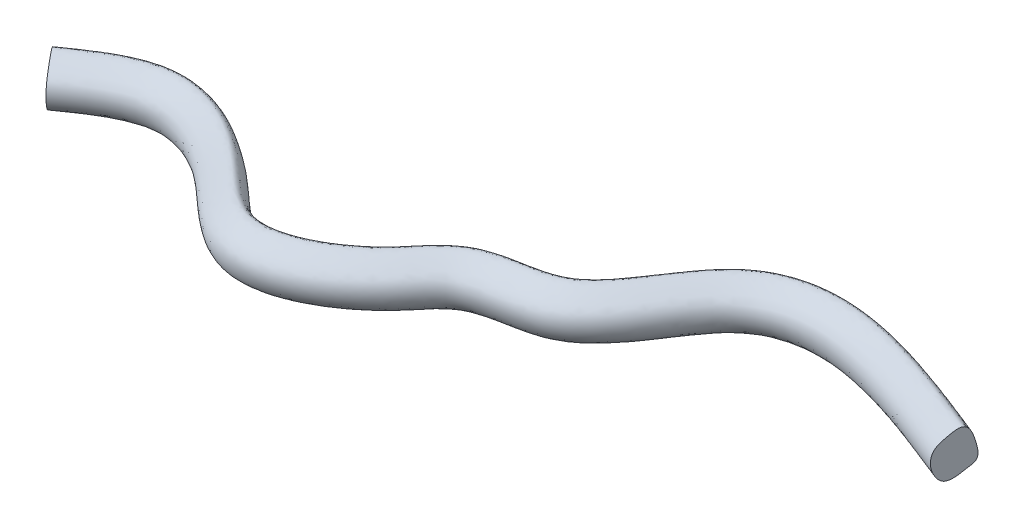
ISO-10303-21;
HEADER;
FILE_DESCRIPTION(('STEP AP214'),'2;1');
FILE_NAME('part.step','',(''),(''),'','','');
FILE_SCHEMA(('AUTOMOTIVE_DESIGN { 1 0 10303 214 1 1 1 1 }'));
ENDSEC;
DATA;
#1=APPLICATION_CONTEXT('core data for automotive mechanical design processes');
#2=APPLICATION_PROTOCOL_DEFINITION('international standard','automotive_design',2000,#1);
#3=PRODUCT_CONTEXT('',#1,'mechanical');
#4=PRODUCT('Part','Part','',(#3));
#5=PRODUCT_RELATED_PRODUCT_CATEGORY('part','',(#4));
#6=PRODUCT_DEFINITION_FORMATION('','',#4);
#7=PRODUCT_DEFINITION_CONTEXT('part definition',#1,'design');
#8=PRODUCT_DEFINITION('design','',#6,#7);
#9=PRODUCT_DEFINITION_SHAPE('','',#8);
#10=(LENGTH_UNIT() NAMED_UNIT(*) SI_UNIT(.MILLI.,.METRE.));
#11=(NAMED_UNIT(*) PLANE_ANGLE_UNIT() SI_UNIT($,.RADIAN.));
#12=(NAMED_UNIT(*) SI_UNIT($,.STERADIAN.) SOLID_ANGLE_UNIT());
#13=UNCERTAINTY_MEASURE_WITH_UNIT(LENGTH_MEASURE(1.E-05),#10,'distance_accuracy_value','');
#14=(GEOMETRIC_REPRESENTATION_CONTEXT(3) GLOBAL_UNCERTAINTY_ASSIGNED_CONTEXT((#13)) GLOBAL_UNIT_ASSIGNED_CONTEXT((#10,
#11,#12)) REPRESENTATION_CONTEXT('',''));
#15=CARTESIAN_POINT('',(0.,0.,0.));
#16=DIRECTION('',(0.,0.,1.));
#17=DIRECTION('',(1.,0.,0.));
#18=AXIS2_PLACEMENT_3D('',#15,#16,#17);
#19=CARTESIAN_POINT('',(489.62322241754,-7.97573868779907,-61.8399710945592));
#20=DIRECTION('',(-0.92851920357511,0.,-0.371284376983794));
#21=DIRECTION('',(-0.371284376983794,0.,0.92851920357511));
#22=AXIS2_PLACEMENT_3D('',#19,#20,#21);
#23=PLANE('',#22);
#24=CARTESIAN_POINT('',(488.404273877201,19.1868210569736,-58.7915877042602));
#25=CARTESIAN_POINT('',(487.05176218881,16.8016183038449,-55.4091855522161));
#26=CARTESIAN_POINT('',(484.873943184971,12.9421402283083,-49.9628298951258));
#27=CARTESIAN_POINT('',(484.06816624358,0.761024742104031,-47.9477185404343));
#28=CARTESIAN_POINT('',(487.092163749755,-13.249863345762,-55.5102229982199));
#29=CARTESIAN_POINT('',(493.313817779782,-1.54614979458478,-71.0695236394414));
#30=CARTESIAN_POINT('',(495.252782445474,-0.278483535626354,-75.918545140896));
#31=CARTESIAN_POINT('',(492.23779678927,25.931165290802,-68.3785777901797));
#32=CARTESIAN_POINT('',(490.142359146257,22.2519966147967,-63.1382439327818));
#33=CARTESIAN_POINT('',(488.404273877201,19.1868210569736,-58.7915877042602));
#34=B_SPLINE_CURVE_WITH_KNOTS('',3,(#24,#25,#26,#27,#28,#29,#30,#31,#32,#33),.UNSPECIFIED.,.T.,
.F.,(4,1,1,1,1,2,4),(0.,0.138177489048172,0.264870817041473,0.420878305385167,0.588308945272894,
0.822430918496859,1.),.UNSPECIFIED.);
#35=CARTESIAN_POINT('',(488.404273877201,19.1868210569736,-58.7915877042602));
#36=VERTEX_POINT('',#35);
#37=EDGE_CURVE('E57',#36,#36,#34,.T.);
#38=ORIENTED_EDGE('',*,*,#37,.T.);
#39=EDGE_LOOP('',(#38));
#40=FACE_BOUND('',#39,.T.);
#41=ADVANCED_FACE('F48',(#40),#23,.F.);
#42=CARTESIAN_POINT('',(-74.1154910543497,-7.97573868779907,29.8287356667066));
#43=DIRECTION('',(-0.817208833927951,0.,0.576341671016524));
#44=DIRECTION('',(0.576341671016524,0.,0.817208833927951));
#45=AXIS2_PLACEMENT_3D('',#42,#43,#44);
#46=PLANE('',#45);
#47=CARTESIAN_POINT('',(-72.2233273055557,19.1868210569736,32.5116805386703));
#48=CARTESIAN_POINT('',(-70.1238345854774,16.8016183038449,35.4886021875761));
#49=CARTESIAN_POINT('',(-66.7432241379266,12.9421402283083,40.2820517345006));
#50=CARTESIAN_POINT('',(-65.4924232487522,0.761024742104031,42.0555926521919));
#51=CARTESIAN_POINT('',(-70.1865495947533,-13.249863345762,35.3996770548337));
#52=CARTESIAN_POINT('',(-79.8443717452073,-1.54614979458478,21.7056167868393));
#53=CARTESIAN_POINT('',(-82.8542105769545,-0.278483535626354,17.4378933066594));
#54=CARTESIAN_POINT('',(-78.1740732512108,25.931165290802,24.0739735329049));
#55=CARTESIAN_POINT('',(-74.9213427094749,22.2519966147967,28.6860990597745));
#56=CARTESIAN_POINT('',(-72.2233273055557,19.1868210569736,32.5116805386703));
#57=B_SPLINE_CURVE_WITH_KNOTS('',3,(#47,#48,#49,#50,#51,#52,#53,#54,#55,#56),.UNSPECIFIED.,.T.,
.F.,(4,1,1,1,1,2,4),(0.,0.138177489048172,0.264870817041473,0.420878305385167,0.588308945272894,
0.822430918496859,1.),.UNSPECIFIED.);
#58=CARTESIAN_POINT('',(-72.2233273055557,19.1868210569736,32.5116805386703));
#59=VERTEX_POINT('',#58);
#60=EDGE_CURVE('E11',#59,#59,#57,.T.);
#61=ORIENTED_EDGE('',*,*,#60,.F.);
#62=EDGE_LOOP('',(#61));
#63=FACE_BOUND('',#62,.T.);
#64=ADVANCED_FACE('F50',(#63),#46,.T.);
#65=CARTESIAN_POINT('',(-72.2233273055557,19.1868210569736,32.5116805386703));
#66=CARTESIAN_POINT('',(-66.4321312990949,19.1868210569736,28.4274170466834));
#67=CARTESIAN_POINT('',(-54.8497392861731,19.1868210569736,20.2588900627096));
#68=CARTESIAN_POINT('',(-37.1470998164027,19.1868210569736,10.231216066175));
#69=CARTESIAN_POINT('',(-24.617602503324,19.1868210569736,6.45367876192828));
#70=CARTESIAN_POINT('',(-12.0781668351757,19.1868210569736,5.14505596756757));
#71=CARTESIAN_POINT('',(7.17624918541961,19.1868210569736,6.6392831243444));
#72=CARTESIAN_POINT('',(27.8970371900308,19.1868210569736,17.0897147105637));
#73=CARTESIAN_POINT('',(51.003205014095,19.1868210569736,34.241826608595));
#74=CARTESIAN_POINT('',(64.6861095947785,19.1868210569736,47.7929007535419));
#75=CARTESIAN_POINT('',(80.4896973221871,19.1868210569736,60.1644329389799));
#76=CARTESIAN_POINT('',(89.7783298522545,19.1868210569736,65.4418913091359));
#77=CARTESIAN_POINT('',(97.3213313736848,19.1868210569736,68.0033436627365));
#78=CARTESIAN_POINT('',(105.191920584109,19.1868210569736,69.4591728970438));
#79=CARTESIAN_POINT('',(115.132071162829,19.1868210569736,69.4418272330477));
#80=CARTESIAN_POINT('',(128.007667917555,19.1868210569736,66.660395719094));
#81=CARTESIAN_POINT('',(143.893664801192,19.1868210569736,60.3505195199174));
#82=CARTESIAN_POINT('',(161.903048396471,19.1868210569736,49.1679760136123));
#83=CARTESIAN_POINT('',(174.10468618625,19.1868210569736,38.0891082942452));
#84=CARTESIAN_POINT('',(183.649802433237,19.1868210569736,27.6605868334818));
#85=CARTESIAN_POINT('',(190.725184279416,19.1868210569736,18.6598702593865));
#86=CARTESIAN_POINT('',(198.935044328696,19.1868210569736,10.9014222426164));
#87=CARTESIAN_POINT('',(211.028158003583,19.1868210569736,3.8214814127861));
#88=CARTESIAN_POINT('',(229.450798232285,19.1868210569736,0.0955129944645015));
#89=CARTESIAN_POINT('',(247.508665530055,19.1868210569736,-3.20418501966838));
#90=CARTESIAN_POINT('',(263.128414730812,19.1868210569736,-10.5229592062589));
#91=CARTESIAN_POINT('',(279.727621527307,19.1868210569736,-24.8918301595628));
#92=CARTESIAN_POINT('',(296.8354193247,19.1868210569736,-53.2556760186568));
#93=CARTESIAN_POINT('',(312.80972250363,19.1868210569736,-74.2353060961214));
#94=CARTESIAN_POINT('',(327.595655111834,19.1868210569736,-85.4326212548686));
#95=CARTESIAN_POINT('',(343.549005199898,19.1868210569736,-91.8964269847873));
#96=CARTESIAN_POINT('',(363.749364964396,19.1868210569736,-94.2565544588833));
#97=CARTESIAN_POINT('',(385.747193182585,19.1868210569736,-92.4888369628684));
#98=CARTESIAN_POINT('',(425.93988583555,19.1868210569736,-83.7712171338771));
#99=CARTESIAN_POINT('',(461.458851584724,19.1868210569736,-69.5671141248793));
#100=CARTESIAN_POINT('',(488.404273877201,19.1868210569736,-58.7915877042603));
#101=CARTESIAN_POINT('',(-70.1238345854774,16.8016183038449,35.4886021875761));
#102=CARTESIAN_POINT('',(-64.3601600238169,16.8016183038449,31.4236215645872));
#103=CARTESIAN_POINT('',(-52.8328109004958,16.8016183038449,23.2936603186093));
#104=CARTESIAN_POINT('',(-35.5955759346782,16.8016183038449,13.5648454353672));
#105=CARTESIAN_POINT('',(-23.8257893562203,16.8016183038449,10.0359686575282));
#106=CARTESIAN_POINT('',(-12.0884463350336,16.8016183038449,8.80621622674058));
#107=CARTESIAN_POINT('',(5.89221857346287,16.8016183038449,10.1910900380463));
#108=CARTESIAN_POINT('',(26.0005741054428,16.8016183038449,20.2201296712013));
#109=CARTESIAN_POINT('',(48.60620474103,16.8016183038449,36.995958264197));
#110=CARTESIAN_POINT('',(62.1480162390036,16.8016183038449,50.4218539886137));
#111=CARTESIAN_POINT('',(78.4059273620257,16.8016183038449,63.1652259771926));
#112=CARTESIAN_POINT('',(88.2047398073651,16.8016183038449,68.7598986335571));
#113=CARTESIAN_POINT('',(96.3894046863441,16.8016183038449,71.5300433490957));
#114=CARTESIAN_POINT('',(104.928446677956,16.8016183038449,73.1209105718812));
#115=CARTESIAN_POINT('',(115.5698302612,16.8016183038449,73.0829782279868));
#116=CARTESIAN_POINT('',(129.103099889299,16.8016183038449,70.1525291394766));
#117=CARTESIAN_POINT('',(145.59914385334,16.8016183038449,63.5889476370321));
#118=CARTESIAN_POINT('',(164.100006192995,16.8016183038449,52.1108731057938));
#119=CARTESIAN_POINT('',(176.667529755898,16.8016183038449,40.6648068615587));
#120=CARTESIAN_POINT('',(186.438457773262,16.8016183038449,30.0236420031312));
#121=CARTESIAN_POINT('',(193.63177732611,16.8016183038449,20.9272539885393));
#122=CARTESIAN_POINT('',(201.104719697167,16.8016183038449,13.8227483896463));
#123=CARTESIAN_POINT('',(212.259572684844,16.8016183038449,7.35792659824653));
#124=CARTESIAN_POINT('',(229.685284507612,16.8016183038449,3.72310535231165));
#125=CARTESIAN_POINT('',(248.619509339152,16.8016183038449,0.307989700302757));
#126=CARTESIAN_POINT('',(265.130709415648,16.8016183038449,-7.44764212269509));
#127=CARTESIAN_POINT('',(282.845125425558,16.8016183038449,-22.7904308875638));
#128=CARTESIAN_POINT('',(300.020783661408,16.8016183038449,-51.4498223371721));
#129=CARTESIAN_POINT('',(315.391691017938,16.8016183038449,-71.6506392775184));
#130=CARTESIAN_POINT('',(329.415644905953,16.8016183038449,-82.2194442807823));
#131=CARTESIAN_POINT('',(344.399577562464,16.8016183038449,-88.3058906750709));
#132=CARTESIAN_POINT('',(363.757870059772,16.8016183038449,-90.5925070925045));
#133=CARTESIAN_POINT('',(385.1695668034,16.8016183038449,-88.8809675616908));
#134=CARTESIAN_POINT('',(424.711702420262,16.8016183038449,-80.3193431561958));
#135=CARTESIAN_POINT('',(460.159971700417,16.8016183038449,-66.1547437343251));
#136=CARTESIAN_POINT('',(487.05176218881,16.8016183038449,-55.4091855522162));
#137=CARTESIAN_POINT('',(-66.7432241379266,12.9421402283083,40.2820517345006));
#138=CARTESIAN_POINT('',(-61.0238647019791,12.9421402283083,36.2481204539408));
#139=CARTESIAN_POINT('',(-49.5851458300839,12.9421402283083,28.1802578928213));
#140=CARTESIAN_POINT('',(-33.0973068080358,12.9421402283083,18.9326669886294));
#141=CARTESIAN_POINT('',(-22.5508090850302,12.9421402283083,15.8041842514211));
#142=CARTESIAN_POINT('',(-12.1049984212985,12.9421402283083,14.7014291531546));
#143=CARTESIAN_POINT('',(3.8246680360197,12.9421402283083,15.910221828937));
#144=CARTESIAN_POINT('',(22.9468826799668,12.9421402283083,25.2607346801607));
#145=CARTESIAN_POINT('',(44.7465466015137,12.9421402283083,41.4306705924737));
#146=CARTESIAN_POINT('',(58.0611695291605,12.9421402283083,54.6550035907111));
#147=CARTESIAN_POINT('',(75.0506337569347,12.9421402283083,67.997113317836));
#148=CARTESIAN_POINT('',(85.6709396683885,12.9421402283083,74.1025655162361));
#149=CARTESIAN_POINT('',(94.8888131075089,12.9421402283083,77.2087473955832));
#150=CARTESIAN_POINT('',(104.504200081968,12.9421402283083,79.0170532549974));
#151=CARTESIAN_POINT('',(116.274711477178,12.9421402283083,78.9459721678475));
#152=CARTESIAN_POINT('',(130.866968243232,12.9421402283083,75.7755744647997));
#153=CARTESIAN_POINT('',(148.345312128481,12.9421402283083,68.8034758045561));
#154=CARTESIAN_POINT('',(167.637555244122,12.9421402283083,56.849536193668));
#155=CARTESIAN_POINT('',(180.794229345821,12.9421402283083,44.8122056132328));
#156=CARTESIAN_POINT('',(190.928760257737,12.9421402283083,33.8286416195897));
#157=CARTESIAN_POINT('',(198.311983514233,12.9421402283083,24.5782031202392));
#158=CARTESIAN_POINT('',(204.598338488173,12.9421402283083,18.526677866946));
#159=CARTESIAN_POINT('',(214.242400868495,12.9421402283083,13.0523228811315));
#160=CARTESIAN_POINT('',(230.062855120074,12.9421402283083,9.56426712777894));
#161=CARTESIAN_POINT('',(250.408193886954,12.9421402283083,5.96330559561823));
#162=CARTESIAN_POINT('',(268.354811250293,12.9421402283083,-2.49575590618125));
#163=CARTESIAN_POINT('',(287.864940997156,12.9421402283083,-19.4067505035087));
#164=CARTESIAN_POINT('',(305.149868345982,12.9421402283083,-48.5420304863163));
#165=CARTESIAN_POINT('',(319.549185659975,12.9421402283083,-67.4887998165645));
#166=CARTESIAN_POINT('',(332.346198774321,12.9421402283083,-77.0455755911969));
#167=CARTESIAN_POINT('',(345.769172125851,12.9421402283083,-82.5243966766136));
#168=CARTESIAN_POINT('',(363.771564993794,12.9421402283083,-84.6926453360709));
#169=CARTESIAN_POINT('',(384.239470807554,12.9421402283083,-83.0715637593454));
#170=CARTESIAN_POINT('',(422.734077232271,12.9421402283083,-74.7611237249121));
#171=CARTESIAN_POINT('',(458.068510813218,12.9421402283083,-60.660133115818));
#172=CARTESIAN_POINT('',(484.873943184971,12.9421402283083,-49.9628298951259));
#173=CARTESIAN_POINT('',(-65.4924232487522,0.761024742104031,42.0555926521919));
#174=CARTESIAN_POINT('',(-59.7894600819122,0.761024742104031,38.033149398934));
#175=CARTESIAN_POINT('',(-48.383533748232,0.761024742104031,29.9882628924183));
#176=CARTESIAN_POINT('',(-32.1729656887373,0.761024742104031,20.9187213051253));
#177=CARTESIAN_POINT('',(-22.0790758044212,0.761024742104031,17.9383814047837));
#178=CARTESIAN_POINT('',(-12.1111225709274,0.761024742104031,16.8826143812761));
#179=CARTESIAN_POINT('',(3.05968961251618,0.761024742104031,18.0262583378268));
#180=CARTESIAN_POINT('',(21.817039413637,0.761024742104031,27.1257212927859));
#181=CARTESIAN_POINT('',(43.318501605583,0.761024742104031,43.0714813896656));
#182=CARTESIAN_POINT('',(56.5490664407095,0.761024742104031,56.2212376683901));
#183=CARTESIAN_POINT('',(73.8091999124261,0.761024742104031,69.7848759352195));
#184=CARTESIAN_POINT('',(84.7334523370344,0.761024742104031,76.0793127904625));
#185=CARTESIAN_POINT('',(94.3336053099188,0.761024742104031,79.3098259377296));
#186=CARTESIAN_POINT('',(104.347231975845,0.761024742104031,81.1985824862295));
#187=CARTESIAN_POINT('',(116.535512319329,0.761024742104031,81.1152366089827));
#188=CARTESIAN_POINT('',(131.519586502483,0.761024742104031,77.8560596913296));
#189=CARTESIAN_POINT('',(149.361374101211,0.761024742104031,70.7328127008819));
#190=CARTESIAN_POINT('',(168.946422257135,0.761024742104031,58.6028065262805));
#191=CARTESIAN_POINT('',(182.321077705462,0.761024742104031,46.3467125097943));
#192=CARTESIAN_POINT('',(192.590139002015,0.761024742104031,35.2364633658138));
#193=CARTESIAN_POINT('',(200.043625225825,0.761024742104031,25.9290273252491));
#194=CARTESIAN_POINT('',(205.890951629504,0.761024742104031,20.2670970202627));
#195=CARTESIAN_POINT('',(214.976032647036,0.761024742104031,15.1592074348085));
#196=CARTESIAN_POINT('',(230.20255345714,0.761024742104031,11.7254538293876));
#197=CARTESIAN_POINT('',(251.069993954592,0.761024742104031,8.05573069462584));
#198=CARTESIAN_POINT('',(269.547705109,0.761024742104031,-0.663594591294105));
#199=CARTESIAN_POINT('',(289.722235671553,0.761024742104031,-18.1548137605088));
#200=CARTESIAN_POINT('',(307.047591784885,0.761024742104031,-47.4661689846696));
#201=CARTESIAN_POINT('',(321.08742796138,0.761024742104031,-65.9489499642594));
#202=CARTESIAN_POINT('',(333.430482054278,0.761024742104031,-75.1312824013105));
#203=CARTESIAN_POINT('',(346.27591199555,0.761024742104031,-80.3852866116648));
#204=CARTESIAN_POINT('',(363.776632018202,0.761024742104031,-82.5097400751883));
#205=CARTESIAN_POINT('',(383.895342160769,0.761024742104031,-80.9221272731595));
#206=CARTESIAN_POINT('',(422.002370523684,0.761024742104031,-72.7046236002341));
#207=CARTESIAN_POINT('',(457.294685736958,0.761024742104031,-58.6271677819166));
#208=CARTESIAN_POINT('',(484.06816624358,0.761024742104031,-47.9477185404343));
#209=CARTESIAN_POINT('',(-70.1865495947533,-13.249863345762,35.3996770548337));
#210=CARTESIAN_POINT('',(-64.4220529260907,-13.249863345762,31.3341204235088));
#211=CARTESIAN_POINT('',(-52.8930595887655,-13.249863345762,23.2030071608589));
#212=CARTESIAN_POINT('',(-35.6419222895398,-13.249863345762,13.4652649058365));
#213=CARTESIAN_POINT('',(-23.8494420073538,-13.249863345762,9.9289602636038));
#214=CARTESIAN_POINT('',(-12.0881392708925,-13.249863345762,8.69685185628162));
#215=CARTESIAN_POINT('',(5.93057450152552,-13.249863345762,10.084992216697));
#216=CARTESIAN_POINT('',(26.0572243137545,-13.249863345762,20.1266194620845));
#217=CARTESIAN_POINT('',(48.6778067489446,-13.249863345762,36.9136882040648));
#218=CARTESIAN_POINT('',(62.2238329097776,-13.249863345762,50.3433231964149));
#219=CARTESIAN_POINT('',(78.4681727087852,-13.249863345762,63.0755877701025));
#220=CARTESIAN_POINT('',(88.251745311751,-13.249863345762,68.6607847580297));
#221=CARTESIAN_POINT('',(96.4172427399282,-13.249863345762,71.4246955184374));
#222=CARTESIAN_POINT('',(104.936317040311,-13.249863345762,73.0115289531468));
#223=CARTESIAN_POINT('',(115.556753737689,-13.249863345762,72.9742115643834));
#224=CARTESIAN_POINT('',(129.070377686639,-13.249863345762,70.0482138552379));
#225=CARTESIAN_POINT('',(145.548198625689,-13.249863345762,63.4922109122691));
#226=CARTESIAN_POINT('',(164.034379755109,-13.249863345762,52.0229643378));
#227=CARTESIAN_POINT('',(176.590973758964,-13.249863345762,40.5878668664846));
#228=CARTESIAN_POINT('',(186.355156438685,-13.249863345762,29.9530539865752));
#229=CARTESIAN_POINT('',(193.544953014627,-13.249863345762,20.8595238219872));
#230=CARTESIAN_POINT('',(201.039908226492,-13.249863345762,13.7354839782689));
#231=CARTESIAN_POINT('',(212.222788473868,-13.249863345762,7.2522876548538));
#232=CARTESIAN_POINT('',(229.678280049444,-13.249863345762,3.61474370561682));
#233=CARTESIAN_POINT('',(248.586326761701,-13.249863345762,0.203075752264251));
#234=CARTESIAN_POINT('',(265.07089785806,-13.249863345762,-7.53950647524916));
#235=CARTESIAN_POINT('',(282.752000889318,-13.249863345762,-22.8532028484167));
#236=CARTESIAN_POINT('',(299.925632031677,-13.249863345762,-51.5037659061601));
#237=CARTESIAN_POINT('',(315.314563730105,-13.249863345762,-71.7278471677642));
#238=CARTESIAN_POINT('',(329.361279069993,-13.249863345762,-82.3154267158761));
#239=CARTESIAN_POINT('',(344.374169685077,-13.249863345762,-88.4131454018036));
#240=CARTESIAN_POINT('',(363.757615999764,-13.249863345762,-90.7019577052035));
#241=CARTESIAN_POINT('',(385.186821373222,-13.249863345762,-88.9887400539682));
#242=CARTESIAN_POINT('',(424.748390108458,-13.249863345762,-80.4224558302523));
#243=CARTESIAN_POINT('',(460.198771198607,-13.249863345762,-66.2566763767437));
#244=CARTESIAN_POINT('',(487.092163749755,-13.249863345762,-55.5102229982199));
#245=CARTESIAN_POINT('',(-79.8443717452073,-1.54614979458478,21.7056167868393));
#246=CARTESIAN_POINT('',(-73.9532743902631,-1.54614979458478,17.55135752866));
#247=CARTESIAN_POINT('',(-62.1710796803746,-1.54614979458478,9.24283901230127));
#248=CARTESIAN_POINT('',(-42.7790471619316,-1.54614979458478,-1.86967731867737));
#249=CARTESIAN_POINT('',(-27.4918411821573,-1.54614979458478,-6.54983881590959));
#250=CARTESIAN_POINT('',(-12.0408528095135,-1.54614979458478,-8.14475674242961));
#251=CARTESIAN_POINT('',(11.8372105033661,-1.54614979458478,-6.25358288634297));
#252=CARTESIAN_POINT('',(34.7810950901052,-1.54614979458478,5.72647858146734));
#253=CARTESIAN_POINT('',(59.7041856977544,-1.54614979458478,24.2444784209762));
#254=CARTESIAN_POINT('',(73.8992504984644,-1.54614979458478,38.2499434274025));
#255=CARTESIAN_POINT('',(88.0536689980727,-1.54614979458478,49.2717173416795));
#256=CARTESIAN_POINT('',(95.4903761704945,-1.54614979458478,53.397705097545));
#257=CARTESIAN_POINT('',(100.704174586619,-1.54614979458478,55.2016155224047));
#258=CARTESIAN_POINT('',(106.148316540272,-1.54614979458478,56.1672641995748));
#259=CARTESIAN_POINT('',(113.543029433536,-1.54614979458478,56.2246470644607));
#260=CARTESIAN_POINT('',(124.031309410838,-1.54614979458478,53.9841412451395));
#261=CARTESIAN_POINT('',(137.702868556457,-1.54614979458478,48.5952015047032));
#262=CARTESIAN_POINT('',(153.928211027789,-1.54614979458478,38.4854195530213));
#263=CARTESIAN_POINT('',(164.801703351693,-1.54614979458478,28.7394625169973));
#264=CARTESIAN_POINT('',(173.527135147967,-1.54614979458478,19.0828250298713));
#265=CARTESIAN_POINT('',(180.174409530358,-1.54614979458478,10.4293905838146));
#266=CARTESIAN_POINT('',(191.059240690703,-1.54614979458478,0.297167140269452));
#267=CARTESIAN_POINT('',(206.558189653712,-1.54614979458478,-9.01562235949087));
#268=CARTESIAN_POINT('',(228.59962580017,-1.54614979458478,-13.0724500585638));
#269=CARTESIAN_POINT('',(243.476362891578,-1.54614979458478,-15.9531883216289));
#270=CARTESIAN_POINT('',(255.860193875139,-1.54614979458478,-21.6861930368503));
#271=CARTESIAN_POINT('',(268.411251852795,-1.54614979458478,-32.519795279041));
#272=CARTESIAN_POINT('',(285.272719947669,-1.54614979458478,-59.8108267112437));
#273=CARTESIAN_POINT('',(303.43731715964,-1.54614979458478,-83.6175061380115));
#274=CARTESIAN_POINT('',(320.989191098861,-1.54614979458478,-97.096278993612));
#275=CARTESIAN_POINT('',(340.461473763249,-1.54614979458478,-104.92987859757));
#276=CARTESIAN_POINT('',(363.718491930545,-1.54614979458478,-107.556847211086));
#277=CARTESIAN_POINT('',(387.843945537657,-1.54614979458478,-105.585206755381));
#278=CARTESIAN_POINT('',(430.398124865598,-1.54614979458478,-96.3013320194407));
#279=CARTESIAN_POINT('',(466.173714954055,-1.54614979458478,-81.953833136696));
#280=CARTESIAN_POINT('',(493.313817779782,-1.54614979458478,-71.0695236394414));
#281=CARTESIAN_POINT('',(-82.8542105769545,-0.278483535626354,17.4378933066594));
#282=CARTESIAN_POINT('',(-76.9236583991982,-0.278483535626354,13.2559900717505));
#283=CARTESIAN_POINT('',(-65.0625540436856,-0.278483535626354,4.89218360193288));
#284=CARTESIAN_POINT('',(-45.0033162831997,-0.278483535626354,-6.64877801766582));
#285=CARTESIAN_POINT('',(-28.6269867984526,-0.278483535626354,-11.6854199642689));
#286=CARTESIAN_POINT('',(-12.026116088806,-0.278483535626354,-13.3934066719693));
#287=CARTESIAN_POINT('',(13.6780004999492,-0.278483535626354,-11.3454635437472));
#288=CARTESIAN_POINT('',(37.4998700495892,-0.278483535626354,1.23870664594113));
#289=CARTESIAN_POINT('',(63.1405322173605,-0.278483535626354,20.2961473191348));
#290=CARTESIAN_POINT('',(77.5378684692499,-0.278483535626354,34.4810684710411));
#291=CARTESIAN_POINT('',(91.0409676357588,-0.278483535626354,44.9697717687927));
#292=CARTESIAN_POINT('',(97.7462794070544,-0.278483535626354,48.6410002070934));
#293=CARTESIAN_POINT('',(102.040187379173,-0.278483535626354,50.1457286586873));
#294=CARTESIAN_POINT('',(106.526033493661,-0.278483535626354,50.9177864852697));
#295=CARTESIAN_POINT('',(112.915456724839,-0.278483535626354,51.0046824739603));
#296=CARTESIAN_POINT('',(122.460894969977,-0.278483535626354,48.9778086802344));
#297=CARTESIAN_POINT('',(135.257888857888,-0.278483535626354,43.9525815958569));
#298=CARTESIAN_POINT('',(150.778645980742,-0.278483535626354,34.2664737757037));
#299=CARTESIAN_POINT('',(161.127603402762,-0.278483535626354,25.0469336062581));
#300=CARTESIAN_POINT('',(169.529310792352,-0.278483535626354,15.6951423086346));
#301=CARTESIAN_POINT('',(176.007509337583,-0.278483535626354,7.17886271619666));
#302=CARTESIAN_POINT('',(187.948787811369,-0.278483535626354,-3.89085446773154));
#303=CARTESIAN_POINT('',(204.792830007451,-0.278483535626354,-14.0854803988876));
#304=CARTESIAN_POINT('',(228.263465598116,-0.278483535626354,-18.2729769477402));
#305=CARTESIAN_POINT('',(241.883853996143,-0.278483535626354,-20.9882521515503));
#306=CARTESIAN_POINT('',(252.989698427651,-0.278483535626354,-26.0949764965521));
#307=CARTESIAN_POINT('',(263.941989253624,-0.278483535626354,-35.5323673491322));
#308=CARTESIAN_POINT('',(280.706172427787,-0.278483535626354,-62.3997037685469));
#309=CARTESIAN_POINT('',(299.735799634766,-0.278483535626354,-87.3228919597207));
#310=CARTESIAN_POINT('',(318.380048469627,-0.278483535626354,-101.702698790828));
#311=CARTESIAN_POINT('',(339.242090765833,-0.278483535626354,-110.077281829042));
#312=CARTESIAN_POINT('',(363.706299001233,-0.278483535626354,-112.809636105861));
#313=CARTESIAN_POINT('',(388.672032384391,-0.278483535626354,-110.757458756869));
#314=CARTESIAN_POINT('',(432.158852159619,-0.278483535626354,-101.249948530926));
#315=CARTESIAN_POINT('',(468.035792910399,-0.278483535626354,-86.8458171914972));
#316=CARTESIAN_POINT('',(495.252782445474,-0.278483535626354,-75.9185451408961));
#317=CARTESIAN_POINT('',(-78.1740732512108,25.931165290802,24.0739735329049));
#318=CARTESIAN_POINT('',(-72.304871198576,25.931165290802,19.9350551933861));
#319=CARTESIAN_POINT('',(-60.5664670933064,25.931165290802,11.6572185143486));
#320=CARTESIAN_POINT('',(-41.5446975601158,25.931165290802,0.782466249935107));
#321=CARTESIAN_POINT('',(-26.861896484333,25.931165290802,-3.69986779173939));
#322=CARTESIAN_POINT('',(-12.0490308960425,25.931165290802,-5.23203863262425));
#323=CARTESIAN_POINT('',(10.8156711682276,25.931165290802,-3.42786328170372));
#324=CARTESIAN_POINT('',(33.2723213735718,25.931165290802,8.2169503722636));
#325=CARTESIAN_POINT('',(57.7971984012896,25.931165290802,26.4355895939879));
#326=CARTESIAN_POINT('',(71.8800134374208,25.931165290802,40.3414661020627));
#327=CARTESIAN_POINT('',(86.3958790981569,25.931165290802,51.65906550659));
#328=CARTESIAN_POINT('',(94.2384713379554,25.931165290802,56.0374201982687));
#329=CARTESIAN_POINT('',(99.9627594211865,25.931165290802,58.0073605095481));
#330=CARTESIAN_POINT('',(105.938703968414,25.931165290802,59.0804416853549));
#331=CARTESIAN_POINT('',(113.891298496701,25.931165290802,59.1214463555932));
#332=CARTESIAN_POINT('',(124.90280487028,25.931165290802,56.7623862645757));
#333=CARTESIAN_POINT('',(139.059700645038,25.931165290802,51.1716055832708));
#334=CARTESIAN_POINT('',(155.676050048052,25.931165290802,40.8267073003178));
#335=CARTESIAN_POINT('',(166.840631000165,25.931165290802,30.7886172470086));
#336=CARTESIAN_POINT('',(175.745712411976,25.931165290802,20.9628065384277));
#337=CARTESIAN_POINT('',(182.486814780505,25.931165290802,12.2332585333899));
#338=CARTESIAN_POINT('',(192.785374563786,25.931165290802,2.62129363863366));
#339=CARTESIAN_POINT('',(207.53786920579,25.931165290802,-6.20212412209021));
#340=CARTESIAN_POINT('',(228.786176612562,25.931165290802,-10.1864376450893));
#341=CARTESIAN_POINT('',(244.360119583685,25.931165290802,-13.1589989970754));
#342=CARTESIAN_POINT('',(257.453164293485,25.931165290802,-19.2395555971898));
#343=CARTESIAN_POINT('',(270.891451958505,25.931165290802,-30.8479799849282));
#344=CARTESIAN_POINT('',(287.806907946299,25.931165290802,-58.3741393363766));
#345=CARTESIAN_POINT('',(305.491460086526,25.931165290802,-81.5612165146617));
#346=CARTESIAN_POINT('',(322.437124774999,25.931165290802,-94.5399640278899));
#347=CARTESIAN_POINT('',(341.138165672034,25.931165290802,-102.073346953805));
#348=CARTESIAN_POINT('',(363.725258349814,25.931165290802,-104.641832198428));
#349=CARTESIAN_POINT('',(387.384401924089,25.931165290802,-102.714885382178));
#350=CARTESIAN_POINT('',(429.421016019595,25.931165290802,-93.5551163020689));
#351=CARTESIAN_POINT('',(465.140361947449,25.931165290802,-79.2390453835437));
#352=CARTESIAN_POINT('',(492.237796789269,25.931165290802,-68.3785777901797));
#353=CARTESIAN_POINT('',(-74.9213427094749,22.2519966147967,28.6860990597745));
#354=CARTESIAN_POINT('',(-69.0947794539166,22.2519966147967,24.5770555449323));
#355=CARTESIAN_POINT('',(-57.4416529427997,22.2519966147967,16.3589685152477));
#356=CARTESIAN_POINT('',(-39.140931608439,22.2519966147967,5.94723674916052));
#357=CARTESIAN_POINT('',(-25.6351454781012,22.2519966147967,1.85015085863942));
#358=CARTESIAN_POINT('',(-12.0649568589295,22.2519966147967,0.440173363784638));
#359=CARTESIAN_POINT('',(8.82633081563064,22.2519966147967,2.07492828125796));
#360=CARTESIAN_POINT('',(30.3341433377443,22.2519966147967,13.0668820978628));
#361=CARTESIAN_POINT('',(54.0835413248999,22.2519966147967,30.7025480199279));
#362=CARTESIAN_POINT('',(67.9477617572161,22.2519966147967,44.4144864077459));
#363=CARTESIAN_POINT('',(83.1675077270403,22.2519966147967,56.3081748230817));
#364=CARTESIAN_POINT('',(91.8005184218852,22.2519966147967,61.1779875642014));
#365=CARTESIAN_POINT('',(98.5189314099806,22.2519966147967,63.4712536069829));
#366=CARTESIAN_POINT('',(105.530505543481,22.2519966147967,64.7535482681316));
#367=CARTESIAN_POINT('',(114.569515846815,22.2519966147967,64.7626581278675));
#368=CARTESIAN_POINT('',(126.599950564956,22.2519966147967,62.1727260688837));
#369=CARTESIAN_POINT('',(141.701988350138,22.2519966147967,56.1888813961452));
#370=CARTESIAN_POINT('',(159.079782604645,22.2519966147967,45.3861188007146));
#371=CARTESIAN_POINT('',(170.811228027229,22.2519966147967,34.7791304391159));
#372=CARTESIAN_POINT('',(180.066158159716,22.2519966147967,24.6238726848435));
#373=CARTESIAN_POINT('',(186.989980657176,22.2519966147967,15.7461015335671));
#374=CARTESIAN_POINT('',(196.146838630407,22.2519966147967,7.14728541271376));
#375=CARTESIAN_POINT('',(209.445692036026,22.2519966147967,-0.723132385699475));
#376=CARTESIAN_POINT('',(229.149464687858,22.2519966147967,-4.56623218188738));
#377=CARTESIAN_POINT('',(246.081142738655,22.2519966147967,-7.71760933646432));
#378=CARTESIAN_POINT('',(260.555306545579,22.2519966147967,-14.4749866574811));
#379=CARTESIAN_POINT('',(275.721380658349,22.2519966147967,-27.5922956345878));
#380=CARTESIAN_POINT('',(292.741972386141,22.2519966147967,-55.576341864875));
#381=CARTESIAN_POINT('',(309.491687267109,22.2519966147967,-77.5568088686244));
#382=CARTESIAN_POINT('',(325.25682323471,22.2519966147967,-89.5618096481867));
#383=CARTESIAN_POINT('',(342.455951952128,22.2519966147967,-96.5105521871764));
#384=CARTESIAN_POINT('',(363.738435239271,22.2519966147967,-98.9651472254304));
#385=CARTESIAN_POINT('',(386.489489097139,22.2519966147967,-97.1252365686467));
#386=CARTESIAN_POINT('',(427.518199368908,22.2519966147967,-88.2071501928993));
#387=CARTESIAN_POINT('',(463.128015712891,22.2519966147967,-73.9522819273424));
#388=CARTESIAN_POINT('',(490.142359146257,22.2519966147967,-63.1382439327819));
#389=CARTESIAN_POINT('',(-72.2233273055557,19.1868210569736,32.5116805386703));
#390=CARTESIAN_POINT('',(-66.4321312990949,19.1868210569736,28.4274170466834));
#391=CARTESIAN_POINT('',(-54.8497392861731,19.1868210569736,20.2588900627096));
#392=CARTESIAN_POINT('',(-37.1470998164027,19.1868210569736,10.231216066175));
#393=CARTESIAN_POINT('',(-24.617602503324,19.1868210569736,6.45367876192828));
#394=CARTESIAN_POINT('',(-12.0781668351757,19.1868210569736,5.14505596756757));
#395=CARTESIAN_POINT('',(7.17624918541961,19.1868210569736,6.6392831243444));
#396=CARTESIAN_POINT('',(27.8970371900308,19.1868210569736,17.0897147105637));
#397=CARTESIAN_POINT('',(51.003205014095,19.1868210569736,34.241826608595));
#398=CARTESIAN_POINT('',(64.6861095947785,19.1868210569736,47.7929007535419));
#399=CARTESIAN_POINT('',(80.4896973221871,19.1868210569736,60.1644329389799));
#400=CARTESIAN_POINT('',(89.7783298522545,19.1868210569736,65.4418913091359));
#401=CARTESIAN_POINT('',(97.3213313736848,19.1868210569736,68.0033436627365));
#402=CARTESIAN_POINT('',(105.191920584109,19.1868210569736,69.4591728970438));
#403=CARTESIAN_POINT('',(115.132071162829,19.1868210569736,69.4418272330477));
#404=CARTESIAN_POINT('',(128.007667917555,19.1868210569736,66.660395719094));
#405=CARTESIAN_POINT('',(143.893664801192,19.1868210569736,60.3505195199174));
#406=CARTESIAN_POINT('',(161.903048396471,19.1868210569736,49.1679760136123));
#407=CARTESIAN_POINT('',(174.10468618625,19.1868210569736,38.0891082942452));
#408=CARTESIAN_POINT('',(183.649802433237,19.1868210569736,27.6605868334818));
#409=CARTESIAN_POINT('',(190.725184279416,19.1868210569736,18.6598702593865));
#410=CARTESIAN_POINT('',(198.935044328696,19.1868210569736,10.9014222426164));
#411=CARTESIAN_POINT('',(211.028158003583,19.1868210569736,3.8214814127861));
#412=CARTESIAN_POINT('',(229.450798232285,19.1868210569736,0.0955129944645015));
#413=CARTESIAN_POINT('',(247.508665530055,19.1868210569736,-3.20418501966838));
#414=CARTESIAN_POINT('',(263.128414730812,19.1868210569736,-10.5229592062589));
#415=CARTESIAN_POINT('',(279.727621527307,19.1868210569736,-24.8918301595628));
#416=CARTESIAN_POINT('',(296.8354193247,19.1868210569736,-53.2556760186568));
#417=CARTESIAN_POINT('',(312.80972250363,19.1868210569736,-74.2353060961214));
#418=CARTESIAN_POINT('',(327.595655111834,19.1868210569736,-85.4326212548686));
#419=CARTESIAN_POINT('',(343.549005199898,19.1868210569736,-91.8964269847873));
#420=CARTESIAN_POINT('',(363.749364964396,19.1868210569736,-94.2565544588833));
#421=CARTESIAN_POINT('',(385.747193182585,19.1868210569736,-92.4888369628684));
#422=CARTESIAN_POINT('',(425.93988583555,19.1868210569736,-83.7712171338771));
#423=CARTESIAN_POINT('',(461.458851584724,19.1868210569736,-69.5671141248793));
#424=CARTESIAN_POINT('',(488.404273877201,19.1868210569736,-58.7915877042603));
#425=B_SPLINE_SURFACE_WITH_KNOTS('',3,3,((#65,#66,#67,#68,#69,#70,#71,#72,#73,#74,#75,#76,#77,
#78,#79,#80,#81,#82,#83,#84,#85,#86,#87,#88,#89,#90,#91,#92,#93,#94,#95,#96,#97,#98,#99,#100),
(#101,#102,#103,#104,#105,#106,#107,#108,#109,#110,#111,#112,#113,#114,#115,#116,#117,#118,#119,
#120,#121,#122,#123,#124,#125,#126,#127,#128,#129,#130,#131,#132,#133,#134,#135,#136),(#137,
#138,#139,#140,#141,#142,#143,#144,#145,#146,#147,#148,#149,#150,#151,#152,#153,#154,#155,#156,
#157,#158,#159,#160,#161,#162,#163,#164,#165,#166,#167,#168,#169,#170,#171,#172),(#173,#174,
#175,#176,#177,#178,#179,#180,#181,#182,#183,#184,#185,#186,#187,#188,#189,#190,#191,#192,#193,
#194,#195,#196,#197,#198,#199,#200,#201,#202,#203,#204,#205,#206,#207,#208),(#209,#210,#211,
#212,#213,#214,#215,#216,#217,#218,#219,#220,#221,#222,#223,#224,#225,#226,#227,#228,#229,#230,
#231,#232,#233,#234,#235,#236,#237,#238,#239,#240,#241,#242,#243,#244),(#245,#246,#247,#248,
#249,#250,#251,#252,#253,#254,#255,#256,#257,#258,#259,#260,#261,#262,#263,#264,#265,#266,#267,
#268,#269,#270,#271,#272,#273,#274,#275,#276,#277,#278,#279,#280),(#281,#282,#283,#284,#285,
#286,#287,#288,#289,#290,#291,#292,#293,#294,#295,#296,#297,#298,#299,#300,#301,#302,#303,#304,
#305,#306,#307,#308,#309,#310,#311,#312,#313,#314,#315,#316),(#317,#318,#319,#320,#321,#322,
#323,#324,#325,#326,#327,#328,#329,#330,#331,#332,#333,#334,#335,#336,#337,#338,#339,#340,#341,
#342,#343,#344,#345,#346,#347,#348,#349,#350,#351,#352),(#353,#354,#355,#356,#357,#358,#359,
#360,#361,#362,#363,#364,#365,#366,#367,#368,#369,#370,#371,#372,#373,#374,#375,#376,#377,#378,
#379,#380,#381,#382,#383,#384,#385,#386,#387,#388),(#389,#390,#391,#392,#393,#394,#395,#396,
#397,#398,#399,#400,#401,#402,#403,#404,#405,#406,#407,#408,#409,#410,#411,#412,#413,#414,#415,
#416,#417,#418,#419,#420,#421,#422,#423,#424)),.UNSPECIFIED.,.T.,.F.,.F.,(4,1,1,1,1,2,4),(4,1,1,
1,1,1,1,1,1,1,1,1,1,1,1,1,1,1,1,1,1,1,1,1,1,1,1,1,1,1,1,1,1,4),(0.,0.138177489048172,
0.264870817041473,0.420878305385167,0.588308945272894,0.822430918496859,1.),(0.,0.03125,0.0625,
0.0937500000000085,0.0952710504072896,0.125000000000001,0.1875,0.196152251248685,
0.249999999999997,0.270833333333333,0.291666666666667,0.304088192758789,0.3125,
0.333333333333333,0.354166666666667,0.375000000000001,0.409999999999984,0.444043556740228,
0.444999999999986,0.4725,0.496073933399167,0.500000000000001,0.541666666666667,
0.582323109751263,0.583333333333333,0.625,0.6875,0.727185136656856,0.75,0.785,0.82,0.855,0.89,
1.),.UNSPECIFIED.);
#426=ORIENTED_EDGE('',*,*,#60,.T.);
#427=EDGE_LOOP('',(#426));
#428=FACE_BOUND('',#427,.T.);
#429=ORIENTED_EDGE('',*,*,#37,.F.);
#430=EDGE_LOOP('',(#429));
#431=FACE_BOUND('',#430,.T.);
#432=ADVANCED_FACE('F69',(#428,#431),#425,.T.);
#433=CLOSED_SHELL('',(#41,#64,#432));
#434=MANIFOLD_SOLID_BREP('B2',#433);
#435=ADVANCED_BREP_SHAPE_REPRESENTATION('',(#18,#434),#14);
#436=SHAPE_DEFINITION_REPRESENTATION(#9,#435);
ENDSEC;
END-ISO-10303-21;
